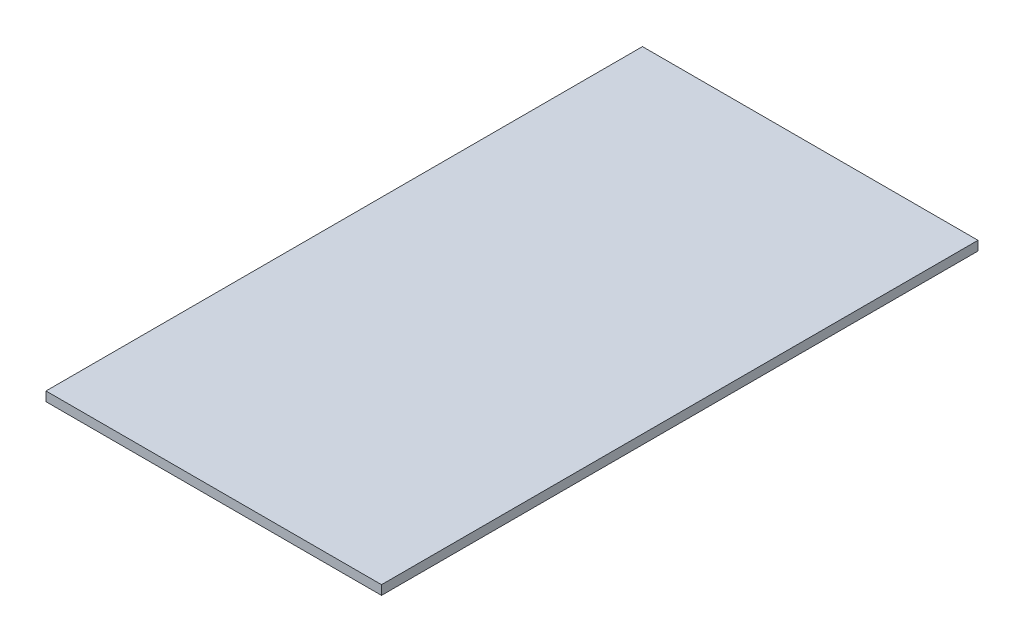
ISO-10303-21;
HEADER;
FILE_DESCRIPTION(('STEP AP214'),'2;1');
FILE_NAME('part.step','',(''),(''),'','','');
FILE_SCHEMA(('AUTOMOTIVE_DESIGN { 1 0 10303 214 1 1 1 1 }'));
ENDSEC;
DATA;
#1=APPLICATION_CONTEXT('core data for automotive mechanical design processes');
#2=APPLICATION_PROTOCOL_DEFINITION('international standard','automotive_design',2000,#1);
#3=PRODUCT_CONTEXT('',#1,'mechanical');
#4=PRODUCT('Part','Part','',(#3));
#5=PRODUCT_RELATED_PRODUCT_CATEGORY('part','',(#4));
#6=PRODUCT_DEFINITION_FORMATION('','',#4);
#7=PRODUCT_DEFINITION_CONTEXT('part definition',#1,'design');
#8=PRODUCT_DEFINITION('design','',#6,#7);
#9=PRODUCT_DEFINITION_SHAPE('','',#8);
#10=(LENGTH_UNIT() NAMED_UNIT(*) SI_UNIT(.MILLI.,.METRE.));
#11=(NAMED_UNIT(*) PLANE_ANGLE_UNIT() SI_UNIT($,.RADIAN.));
#12=(NAMED_UNIT(*) SI_UNIT($,.STERADIAN.) SOLID_ANGLE_UNIT());
#13=UNCERTAINTY_MEASURE_WITH_UNIT(LENGTH_MEASURE(1.E-05),#10,'distance_accuracy_value','');
#14=(GEOMETRIC_REPRESENTATION_CONTEXT(3) GLOBAL_UNCERTAINTY_ASSIGNED_CONTEXT((#13)) GLOBAL_UNIT_ASSIGNED_CONTEXT((#10,
#11,#12)) REPRESENTATION_CONTEXT('',''));
#15=CARTESIAN_POINT('',(0.,0.,0.));
#16=DIRECTION('',(0.,0.,1.));
#17=DIRECTION('',(1.,0.,0.));
#18=AXIS2_PLACEMENT_3D('',#15,#16,#17);
#19=CARTESIAN_POINT('',(0.,19.05,0.));
#20=DIRECTION('',(1.,0.,0.));
#21=DIRECTION('',(0.,0.,-1.));
#22=AXIS2_PLACEMENT_3D('',#19,#20,#21);
#23=PLANE('',#22);
#24=DIRECTION('',(0.,0.,1.));
#25=VECTOR('',#24,1.);
#26=CARTESIAN_POINT('',(0.,0.,0.));
#27=LINE('',#26,#25);
#28=CARTESIAN_POINT('',(0.,0.,-1219.2));
#29=VERTEX_POINT('',#28);
#30=CARTESIAN_POINT('',(0.,0.,0.));
#31=VERTEX_POINT('',#30);
#32=EDGE_CURVE('E95',#29,#31,#27,.T.);
#33=ORIENTED_EDGE('',*,*,#32,.T.);
#34=DIRECTION('',(0.,-1.,0.));
#35=VECTOR('',#34,1.);
#36=CARTESIAN_POINT('',(0.,19.05,0.));
#37=LINE('',#36,#35);
#38=CARTESIAN_POINT('',(0.,19.05,0.));
#39=VERTEX_POINT('',#38);
#40=EDGE_CURVE('E11',#39,#31,#37,.T.);
#41=ORIENTED_EDGE('',*,*,#40,.F.);
#42=DIRECTION('',(0.,0.,1.));
#43=VECTOR('',#42,1.);
#44=CARTESIAN_POINT('',(0.,19.05,0.));
#45=LINE('',#44,#43);
#46=CARTESIAN_POINT('',(0.,19.05,-1219.2));
#47=VERTEX_POINT('',#46);
#48=EDGE_CURVE('E83',#47,#39,#45,.T.);
#49=ORIENTED_EDGE('',*,*,#48,.F.);
#50=DIRECTION('',(0.,-1.,0.));
#51=VECTOR('',#50,1.);
#52=CARTESIAN_POINT('',(0.,19.05,-1219.2));
#53=LINE('',#52,#51);
#54=EDGE_CURVE('E91',#47,#29,#53,.T.);
#55=ORIENTED_EDGE('',*,*,#54,.T.);
#56=EDGE_LOOP('',(#33,#41,#49,#55));
#57=FACE_BOUND('',#56,.T.);
#58=ADVANCED_FACE('F32',(#57),#23,.F.);
#59=CARTESIAN_POINT('',(0.,19.05,0.));
#60=DIRECTION('',(0.,0.,-1.));
#61=DIRECTION('',(-1.,0.,0.));
#62=AXIS2_PLACEMENT_3D('',#59,#60,#61);
#63=PLANE('',#62);
#64=DIRECTION('',(1.,0.,0.));
#65=VECTOR('',#64,1.);
#66=CARTESIAN_POINT('',(0.,0.,0.));
#67=LINE('',#66,#65);
#68=CARTESIAN_POINT('',(685.8,0.,0.));
#69=VERTEX_POINT('',#68);
#70=EDGE_CURVE('E87',#31,#69,#67,.T.);
#71=ORIENTED_EDGE('',*,*,#70,.T.);
#72=DIRECTION('',(0.,-1.,0.));
#73=VECTOR('',#72,1.);
#74=CARTESIAN_POINT('',(685.8,19.05,0.));
#75=LINE('',#74,#73);
#76=CARTESIAN_POINT('',(685.8,19.05,0.));
#77=VERTEX_POINT('',#76);
#78=EDGE_CURVE('E40',#77,#69,#75,.T.);
#79=ORIENTED_EDGE('',*,*,#78,.F.);
#80=DIRECTION('',(1.,0.,0.));
#81=VECTOR('',#80,1.);
#82=CARTESIAN_POINT('',(0.,19.05,0.));
#83=LINE('',#82,#81);
#84=EDGE_CURVE('E78',#39,#77,#83,.T.);
#85=ORIENTED_EDGE('',*,*,#84,.F.);
#86=ORIENTED_EDGE('',*,*,#40,.T.);
#87=EDGE_LOOP('',(#71,#79,#85,#86));
#88=FACE_BOUND('',#87,.T.);
#89=ADVANCED_FACE('F86',(#88),#63,.F.);
#90=CARTESIAN_POINT('',(685.8,19.05,0.));
#91=DIRECTION('',(-1.,0.,0.));
#92=DIRECTION('',(0.,0.,1.));
#93=AXIS2_PLACEMENT_3D('',#90,#91,#92);
#94=PLANE('',#93);
#95=DIRECTION('',(0.,0.,-1.));
#96=VECTOR('',#95,1.);
#97=CARTESIAN_POINT('',(685.8,0.,0.));
#98=LINE('',#97,#96);
#99=CARTESIAN_POINT('',(685.8,0.,-1219.2));
#100=VERTEX_POINT('',#99);
#101=EDGE_CURVE('E65',#69,#100,#98,.T.);
#102=ORIENTED_EDGE('',*,*,#101,.T.);
#103=DIRECTION('',(0.,-1.,0.));
#104=VECTOR('',#103,1.);
#105=CARTESIAN_POINT('',(685.8,19.05,-1219.2));
#106=LINE('',#105,#104);
#107=CARTESIAN_POINT('',(685.8,19.05,-1219.2));
#108=VERTEX_POINT('',#107);
#109=EDGE_CURVE('E88',#108,#100,#106,.T.);
#110=ORIENTED_EDGE('',*,*,#109,.F.);
#111=DIRECTION('',(0.,0.,-1.));
#112=VECTOR('',#111,1.);
#113=CARTESIAN_POINT('',(685.8,19.05,0.));
#114=LINE('',#113,#112);
#115=EDGE_CURVE('E81',#77,#108,#114,.T.);
#116=ORIENTED_EDGE('',*,*,#115,.F.);
#117=ORIENTED_EDGE('',*,*,#78,.T.);
#118=EDGE_LOOP('',(#102,#110,#116,#117));
#119=FACE_BOUND('',#118,.T.);
#120=ADVANCED_FACE('F89',(#119),#94,.F.);
#121=CARTESIAN_POINT('',(0.,19.05,-1219.2));
#122=DIRECTION('',(0.,0.,1.));
#123=DIRECTION('',(1.,0.,0.));
#124=AXIS2_PLACEMENT_3D('',#121,#122,#123);
#125=PLANE('',#124);
#126=DIRECTION('',(-1.,0.,0.));
#127=VECTOR('',#126,1.);
#128=CARTESIAN_POINT('',(0.,0.,-1219.2));
#129=LINE('',#128,#127);
#130=EDGE_CURVE('E71',#100,#29,#129,.T.);
#131=ORIENTED_EDGE('',*,*,#130,.T.);
#132=ORIENTED_EDGE('',*,*,#54,.F.);
#133=DIRECTION('',(-1.,0.,0.));
#134=VECTOR('',#133,1.);
#135=CARTESIAN_POINT('',(0.,19.05,-1219.2));
#136=LINE('',#135,#134);
#137=EDGE_CURVE('E48',#108,#47,#136,.T.);
#138=ORIENTED_EDGE('',*,*,#137,.F.);
#139=ORIENTED_EDGE('',*,*,#109,.T.);
#140=EDGE_LOOP('',(#131,#132,#138,#139));
#141=FACE_BOUND('',#140,.T.);
#142=ADVANCED_FACE('F102',(#141),#125,.F.);
#143=CARTESIAN_POINT('',(0.,19.05,-1219.2));
#144=DIRECTION('',(0.,-1.,0.));
#145=DIRECTION('',(0.,0.,-1.));
#146=AXIS2_PLACEMENT_3D('',#143,#144,#145);
#147=PLANE('',#146);
#148=ORIENTED_EDGE('',*,*,#48,.T.);
#149=ORIENTED_EDGE('',*,*,#84,.T.);
#150=ORIENTED_EDGE('',*,*,#115,.T.);
#151=ORIENTED_EDGE('',*,*,#137,.T.);
#152=EDGE_LOOP('',(#148,#149,#150,#151));
#153=FACE_BOUND('',#152,.T.);
#154=ADVANCED_FACE('F79',(#153),#147,.F.);
#155=CARTESIAN_POINT('',(0.,0.,-1219.2));
#156=DIRECTION('',(0.,-1.,0.));
#157=DIRECTION('',(0.,0.,-1.));
#158=AXIS2_PLACEMENT_3D('',#155,#156,#157);
#159=PLANE('',#158);
#160=ORIENTED_EDGE('',*,*,#32,.F.);
#161=ORIENTED_EDGE('',*,*,#130,.F.);
#162=ORIENTED_EDGE('',*,*,#101,.F.);
#163=ORIENTED_EDGE('',*,*,#70,.F.);
#164=EDGE_LOOP('',(#160,#161,#162,#163));
#165=FACE_BOUND('',#164,.T.);
#166=ADVANCED_FACE('F105',(#165),#159,.T.);
#167=CLOSED_SHELL('',(#58,#89,#120,#142,#154,#166));
#168=MANIFOLD_SOLID_BREP('B2',#167);
#169=ADVANCED_BREP_SHAPE_REPRESENTATION('',(#18,#168),#14);
#170=SHAPE_DEFINITION_REPRESENTATION(#9,#169);
ENDSEC;
END-ISO-10303-21;
